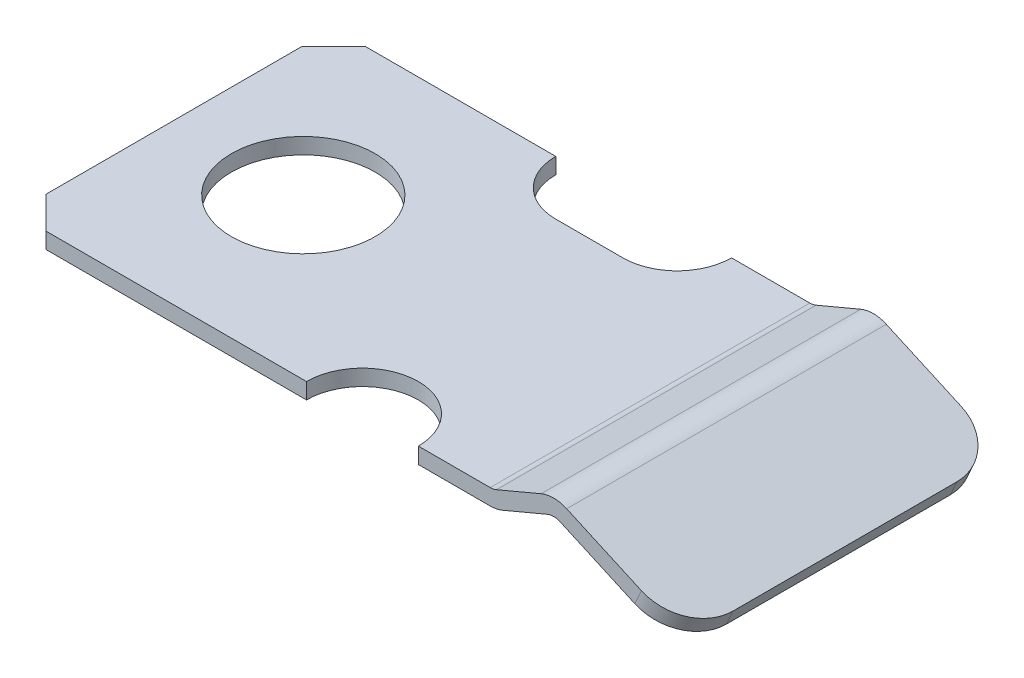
ISO-10303-21;
HEADER;
FILE_DESCRIPTION(('STEP AP214'),'2;1');
FILE_NAME('part.step','',(''),(''),'','','');
FILE_SCHEMA(('AUTOMOTIVE_DESIGN { 1 0 10303 214 1 1 1 1 }'));
ENDSEC;
DATA;
#1=APPLICATION_CONTEXT('core data for automotive mechanical design processes');
#2=APPLICATION_PROTOCOL_DEFINITION('international standard','automotive_design',2000,#1);
#3=PRODUCT_CONTEXT('',#1,'mechanical');
#4=PRODUCT('Part','Part','',(#3));
#5=PRODUCT_RELATED_PRODUCT_CATEGORY('part','',(#4));
#6=PRODUCT_DEFINITION_FORMATION('','',#4);
#7=PRODUCT_DEFINITION_CONTEXT('part definition',#1,'design');
#8=PRODUCT_DEFINITION('design','',#6,#7);
#9=PRODUCT_DEFINITION_SHAPE('','',#8);
#10=(LENGTH_UNIT() NAMED_UNIT(*) SI_UNIT(.MILLI.,.METRE.));
#11=(NAMED_UNIT(*) PLANE_ANGLE_UNIT() SI_UNIT($,.RADIAN.));
#12=(NAMED_UNIT(*) SI_UNIT($,.STERADIAN.) SOLID_ANGLE_UNIT());
#13=UNCERTAINTY_MEASURE_WITH_UNIT(LENGTH_MEASURE(1.E-05),#10,'distance_accuracy_value','');
#14=(GEOMETRIC_REPRESENTATION_CONTEXT(3) GLOBAL_UNCERTAINTY_ASSIGNED_CONTEXT((#13)) GLOBAL_UNIT_ASSIGNED_CONTEXT((#10,
#11,#12)) REPRESENTATION_CONTEXT('',''));
#15=CARTESIAN_POINT('',(0.,0.,0.));
#16=DIRECTION('',(0.,0.,1.));
#17=DIRECTION('',(1.,0.,0.));
#18=AXIS2_PLACEMENT_3D('',#15,#16,#17);
#19=CARTESIAN_POINT('',(14.8987900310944,1.,-5.));
#20=DIRECTION('',(0.,0.,1.));
#21=DIRECTION('',(1.,0.,0.));
#22=AXIS2_PLACEMENT_3D('',#19,#20,#21);
#23=PLANE('',#22);
#24=DIRECTION('',(-0.912195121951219,0.409756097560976,0.));
#25=VECTOR('',#24,1.);
#26=CARTESIAN_POINT('',(21.,-0.543902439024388,-5.));
#27=LINE('',#26,#25);
#28=CARTESIAN_POINT('',(19.6317073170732,0.0707317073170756,-5.));
#29=VERTEX_POINT('',#28);
#30=CARTESIAN_POINT('',(17.2924742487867,1.12151019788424,-5.));
#31=VERTEX_POINT('',#30);
#32=EDGE_CURVE('E321',#29,#31,#27,.T.);
#33=ORIENTED_EDGE('',*,*,#32,.F.);
#34=DIRECTION('',(0.409756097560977,0.912195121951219,0.));
#35=VECTOR('',#34,1.);
#36=CARTESIAN_POINT('',(19.1843898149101,-0.925082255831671,-5.));
#37=LINE('',#36,#35);
#38=CARTESIAN_POINT('',(19.4268292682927,-0.385365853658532,-5.));
#39=VERTEX_POINT('',#38);
#40=EDGE_CURVE('E54',#29,#39,#37,.F.);
#41=ORIENTED_EDGE('',*,*,#40,.T.);
#42=DIRECTION('',(0.912195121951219,-0.409756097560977,0.));
#43=VECTOR('',#42,1.);
#44=CARTESIAN_POINT('',(17.0875962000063,0.665412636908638,-5.));
#45=LINE('',#44,#43);
#46=CARTESIAN_POINT('',(17.0875962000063,0.665412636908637,-5.));
#47=VERTEX_POINT('',#46);
#48=EDGE_CURVE('E310',#47,#39,#45,.T.);
#49=ORIENTED_EDGE('',*,*,#48,.F.);
#50=CARTESIAN_POINT('',(16.8827181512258,0.209315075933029,-5.));
#51=DIRECTION('',(0.,0.,-1.));
#52=DIRECTION('',(-1.,0.,0.));
#53=AXIS2_PLACEMENT_3D('',#50,#51,#52);
#54=CIRCLE('',#53,0.5);
#55=CARTESIAN_POINT('',(16.688265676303,0.669954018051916,-5.));
#56=VERTEX_POINT('',#55);
#57=EDGE_CURVE('E328',#56,#47,#54,.T.);
#58=ORIENTED_EDGE('',*,*,#57,.F.);
#59=DIRECTION('',(0.921277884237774,0.388904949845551,0.));
#60=VECTOR('',#59,1.);
#61=CARTESIAN_POINT('',(15.2876949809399,0.0787221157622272,-5.));
#62=LINE('',#61,#60);
#63=CARTESIAN_POINT('',(15.2876949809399,0.0787221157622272,-5.));
#64=VERTEX_POINT('',#63);
#65=EDGE_CURVE('E352',#64,#56,#62,.T.);
#66=ORIENTED_EDGE('',*,*,#65,.F.);
#67=CARTESIAN_POINT('',(14.8987900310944,1.,-5.));
#68=DIRECTION('',(0.,0.,1.));
#69=DIRECTION('',(1.,0.,0.));
#70=AXIS2_PLACEMENT_3D('',#67,#68,#69);
#71=CIRCLE('',#70,1.);
#72=CARTESIAN_POINT('',(14.8987900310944,0.,-5.));
#73=VERTEX_POINT('',#72);
#74=EDGE_CURVE('E353',#73,#64,#71,.T.);
#75=ORIENTED_EDGE('',*,*,#74,.F.);
#76=DIRECTION('',(1.,0.,0.));
#77=VECTOR('',#76,1.);
#78=CARTESIAN_POINT('',(0.,0.,-5.));
#79=LINE('',#78,#77);
#80=CARTESIAN_POINT('',(12.45,0.,-5.));
#81=VERTEX_POINT('',#80);
#82=EDGE_CURVE('E201',#81,#73,#79,.T.);
#83=ORIENTED_EDGE('',*,*,#82,.F.);
#84=DIRECTION('',(0.,1.,0.));
#85=VECTOR('',#84,1.);
#86=CARTESIAN_POINT('',(12.45,-9.5,-5.));
#87=LINE('',#86,#85);
#88=CARTESIAN_POINT('',(12.45,0.5,-5.));
#89=VERTEX_POINT('',#88);
#90=EDGE_CURVE('E186',#81,#89,#87,.T.);
#91=ORIENTED_EDGE('',*,*,#90,.T.);
#92=DIRECTION('',(-1.,0.,0.));
#93=VECTOR('',#92,1.);
#94=CARTESIAN_POINT('',(0.,0.5,-5.));
#95=LINE('',#94,#93);
#96=CARTESIAN_POINT('',(14.8987900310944,0.499999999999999,-5.));
#97=VERTEX_POINT('',#96);
#98=EDGE_CURVE('E199',#97,#89,#95,.T.);
#99=ORIENTED_EDGE('',*,*,#98,.F.);
#100=CARTESIAN_POINT('',(14.8987900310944,1.,-5.));
#101=DIRECTION('',(0.,0.,-1.));
#102=DIRECTION('',(1.,0.,0.));
#103=AXIS2_PLACEMENT_3D('',#100,#101,#102);
#104=CIRCLE('',#103,0.500000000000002);
#105=CARTESIAN_POINT('',(15.0932425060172,0.539361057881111,-5.));
#106=VERTEX_POINT('',#105);
#107=EDGE_CURVE('E216',#106,#97,#104,.T.);
#108=ORIENTED_EDGE('',*,*,#107,.F.);
#109=DIRECTION('',(-0.921277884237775,-0.388904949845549,0.));
#110=VECTOR('',#109,1.);
#111=CARTESIAN_POINT('',(16.4938132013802,1.1305929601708,-5.));
#112=LINE('',#111,#110);
#113=CARTESIAN_POINT('',(16.4938132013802,1.1305929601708,-5.));
#114=VERTEX_POINT('',#113);
#115=EDGE_CURVE('E326',#114,#106,#112,.T.);
#116=ORIENTED_EDGE('',*,*,#115,.F.);
#117=CARTESIAN_POINT('',(16.8827181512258,0.209315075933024,-5.));
#118=DIRECTION('',(0.,0.,1.));
#119=DIRECTION('',(-1.,0.,0.));
#120=AXIS2_PLACEMENT_3D('',#117,#118,#119);
#121=CIRCLE('',#120,1.);
#122=EDGE_CURVE('E324',#31,#114,#121,.T.);
#123=ORIENTED_EDGE('',*,*,#122,.F.);
#124=EDGE_LOOP('',(#33,#41,#49,#58,#66,#75,#83,#91,#99,#108,#116,#123));
#125=FACE_BOUND('',#124,.T.);
#126=ADVANCED_FACE('F31',(#125),#23,.F.);
#127=CARTESIAN_POINT('',(14.8987900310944,1.,5.));
#128=DIRECTION('',(0.,0.,1.));
#129=DIRECTION('',(1.,0.,0.));
#130=AXIS2_PLACEMENT_3D('',#127,#128,#129);
#131=PLANE('',#130);
#132=DIRECTION('',(0.912195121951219,-0.409756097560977,0.));
#133=VECTOR('',#132,1.);
#134=CARTESIAN_POINT('',(17.0875962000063,0.665412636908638,5.));
#135=LINE('',#134,#133);
#136=CARTESIAN_POINT('',(17.0875962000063,0.665412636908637,5.));
#137=VERTEX_POINT('',#136);
#138=CARTESIAN_POINT('',(19.4268292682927,-0.385365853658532,5.));
#139=VERTEX_POINT('',#138);
#140=EDGE_CURVE('E226',#137,#139,#135,.T.);
#141=ORIENTED_EDGE('',*,*,#140,.T.);
#142=DIRECTION('',(0.409756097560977,0.912195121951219,0.));
#143=VECTOR('',#142,1.);
#144=CARTESIAN_POINT('',(19.6317073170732,0.0707317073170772,5.));
#145=LINE('',#144,#143);
#146=CARTESIAN_POINT('',(19.6317073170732,0.0707317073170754,5.));
#147=VERTEX_POINT('',#146);
#148=EDGE_CURVE('E11',#139,#147,#145,.T.);
#149=ORIENTED_EDGE('',*,*,#148,.T.);
#150=DIRECTION('',(-0.912195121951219,0.409756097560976,0.));
#151=VECTOR('',#150,1.);
#152=CARTESIAN_POINT('',(21.,-0.543902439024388,5.));
#153=LINE('',#152,#151);
#154=CARTESIAN_POINT('',(17.2924742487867,1.12151019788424,5.));
#155=VERTEX_POINT('',#154);
#156=EDGE_CURVE('E228',#147,#155,#153,.T.);
#157=ORIENTED_EDGE('',*,*,#156,.T.);
#158=CARTESIAN_POINT('',(16.8827181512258,0.209315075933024,5.));
#159=DIRECTION('',(0.,0.,1.));
#160=DIRECTION('',(-1.,0.,0.));
#161=AXIS2_PLACEMENT_3D('',#158,#159,#160);
#162=CIRCLE('',#161,1.);
#163=CARTESIAN_POINT('',(16.4938132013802,1.1305929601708,5.));
#164=VERTEX_POINT('',#163);
#165=EDGE_CURVE('E230',#155,#164,#162,.T.);
#166=ORIENTED_EDGE('',*,*,#165,.T.);
#167=DIRECTION('',(-0.921277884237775,-0.388904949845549,0.));
#168=VECTOR('',#167,1.);
#169=CARTESIAN_POINT('',(16.4938132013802,1.1305929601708,5.));
#170=LINE('',#169,#168);
#171=CARTESIAN_POINT('',(15.0932425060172,0.539361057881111,5.));
#172=VERTEX_POINT('',#171);
#173=EDGE_CURVE('E232',#164,#172,#170,.T.);
#174=ORIENTED_EDGE('',*,*,#173,.T.);
#175=CARTESIAN_POINT('',(14.8987900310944,1.,5.));
#176=DIRECTION('',(0.,0.,-1.));
#177=DIRECTION('',(1.,0.,0.));
#178=AXIS2_PLACEMENT_3D('',#175,#176,#177);
#179=CIRCLE('',#178,0.500000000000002);
#180=CARTESIAN_POINT('',(14.8987900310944,0.499999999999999,5.));
#181=VERTEX_POINT('',#180);
#182=EDGE_CURVE('E234',#172,#181,#179,.T.);
#183=ORIENTED_EDGE('',*,*,#182,.T.);
#184=DIRECTION('',(-1.,0.,0.));
#185=VECTOR('',#184,1.);
#186=CARTESIAN_POINT('',(0.,0.5,5.));
#187=LINE('',#186,#185);
#188=CARTESIAN_POINT('',(12.65,0.5,5.));
#189=VERTEX_POINT('',#188);
#190=EDGE_CURVE('E237',#181,#189,#187,.T.);
#191=ORIENTED_EDGE('',*,*,#190,.T.);
#192=DIRECTION('',(0.,1.,0.));
#193=VECTOR('',#192,1.);
#194=CARTESIAN_POINT('',(12.65,-9.5,5.));
#195=LINE('',#194,#193);
#196=CARTESIAN_POINT('',(12.65,0.,5.));
#197=VERTEX_POINT('',#196);
#198=EDGE_CURVE('E277',#197,#189,#195,.T.);
#199=ORIENTED_EDGE('',*,*,#198,.F.);
#200=DIRECTION('',(1.,0.,0.));
#201=VECTOR('',#200,1.);
#202=CARTESIAN_POINT('',(0.,0.,5.));
#203=LINE('',#202,#201);
#204=CARTESIAN_POINT('',(14.8987900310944,0.,5.));
#205=VERTEX_POINT('',#204);
#206=EDGE_CURVE('E211',#197,#205,#203,.T.);
#207=ORIENTED_EDGE('',*,*,#206,.T.);
#208=CARTESIAN_POINT('',(14.8987900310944,1.,5.));
#209=DIRECTION('',(0.,0.,1.));
#210=DIRECTION('',(1.,0.,0.));
#211=AXIS2_PLACEMENT_3D('',#208,#209,#210);
#212=CIRCLE('',#211,1.);
#213=CARTESIAN_POINT('',(15.2876949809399,0.0787221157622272,5.));
#214=VERTEX_POINT('',#213);
#215=EDGE_CURVE('E220',#205,#214,#212,.T.);
#216=ORIENTED_EDGE('',*,*,#215,.T.);
#217=DIRECTION('',(0.921277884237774,0.388904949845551,0.));
#218=VECTOR('',#217,1.);
#219=CARTESIAN_POINT('',(15.2876949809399,0.0787221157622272,5.));
#220=LINE('',#219,#218);
#221=CARTESIAN_POINT('',(16.688265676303,0.669954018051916,5.));
#222=VERTEX_POINT('',#221);
#223=EDGE_CURVE('E222',#214,#222,#220,.T.);
#224=ORIENTED_EDGE('',*,*,#223,.T.);
#225=CARTESIAN_POINT('',(16.8827181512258,0.209315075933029,5.));
#226=DIRECTION('',(0.,0.,-1.));
#227=DIRECTION('',(-1.,0.,0.));
#228=AXIS2_PLACEMENT_3D('',#225,#226,#227);
#229=CIRCLE('',#228,0.5);
#230=EDGE_CURVE('E224',#222,#137,#229,.T.);
#231=ORIENTED_EDGE('',*,*,#230,.T.);
#232=EDGE_LOOP('',(#141,#149,#157,#166,#174,#183,#191,#199,#207,#216,#224,#231));
#233=FACE_BOUND('',#232,.T.);
#234=ADVANCED_FACE('F340',(#233),#131,.T.);
#235=CARTESIAN_POINT('',(0.,0.,5.));
#236=DIRECTION('',(1.,0.,0.));
#237=DIRECTION('',(0.,0.,-1.));
#238=AXIS2_PLACEMENT_3D('',#235,#236,#237);
#239=PLANE('',#238);
#240=DIRECTION('',(0.,0.,-1.));
#241=VECTOR('',#240,1.);
#242=CARTESIAN_POINT('',(0.,0.5,5.));
#243=LINE('',#242,#241);
#244=CARTESIAN_POINT('',(0.,0.5,4.));
#245=VERTEX_POINT('',#244);
#246=CARTESIAN_POINT('',(0.,0.5,-4.));
#247=VERTEX_POINT('',#246);
#248=EDGE_CURVE('E240',#245,#247,#243,.T.);
#249=ORIENTED_EDGE('',*,*,#248,.T.);
#250=DIRECTION('',(0.,-1.,0.));
#251=VECTOR('',#250,1.);
#252=CARTESIAN_POINT('',(0.,0.,-4.));
#253=LINE('',#252,#251);
#254=CARTESIAN_POINT('',(0.,0.,-4.));
#255=VERTEX_POINT('',#254);
#256=EDGE_CURVE('E282',#247,#255,#253,.T.);
#257=ORIENTED_EDGE('',*,*,#256,.T.);
#258=DIRECTION('',(0.,0.,-1.));
#259=VECTOR('',#258,1.);
#260=CARTESIAN_POINT('',(0.,0.,5.));
#261=LINE('',#260,#259);
#262=CARTESIAN_POINT('',(0.,0.,4.));
#263=VERTEX_POINT('',#262);
#264=EDGE_CURVE('E271',#263,#255,#261,.T.);
#265=ORIENTED_EDGE('',*,*,#264,.F.);
#266=DIRECTION('',(0.,1.,0.));
#267=VECTOR('',#266,1.);
#268=CARTESIAN_POINT('',(0.,0.5,4.));
#269=LINE('',#268,#267);
#270=EDGE_CURVE('E202',#263,#245,#269,.T.);
#271=ORIENTED_EDGE('',*,*,#270,.T.);
#272=EDGE_LOOP('',(#249,#257,#265,#271));
#273=FACE_BOUND('',#272,.T.);
#274=ADVANCED_FACE('F405',(#273),#239,.F.);
#275=CARTESIAN_POINT('',(0.,0.,5.));
#276=DIRECTION('',(0.,1.,0.));
#277=DIRECTION('',(0.,0.,1.));
#278=AXIS2_PLACEMENT_3D('',#275,#276,#277);
#279=PLANE('',#278);
#280=CARTESIAN_POINT('',(4.05,0.,0.));
#281=DIRECTION('',(0.,1.,0.));
#282=DIRECTION('',(0.,0.,1.));
#283=AXIS2_PLACEMENT_3D('',#280,#281,#282);
#284=CIRCLE('',#283,2.25);
#285=CARTESIAN_POINT('',(4.05,0.,2.25));
#286=VERTEX_POINT('',#285);
#287=EDGE_CURVE('E359',#286,#286,#284,.T.);
#288=ORIENTED_EDGE('',*,*,#287,.T.);
#289=EDGE_LOOP('',(#288));
#290=FACE_BOUND('',#289,.T.);
#291=ORIENTED_EDGE('',*,*,#264,.T.);
#292=DIRECTION('',(-0.707106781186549,0.,0.707106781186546));
#293=VECTOR('',#292,1.);
#294=CARTESIAN_POINT('',(0.,0.,-4.));
#295=LINE('',#294,#293);
#296=CARTESIAN_POINT('',(1.,0.,-5.));
#297=VERTEX_POINT('',#296);
#298=EDGE_CURVE('E287',#255,#297,#295,.F.);
#299=ORIENTED_EDGE('',*,*,#298,.T.);
#300=CARTESIAN_POINT('',(6.95,0.,-5.));
#301=VERTEX_POINT('',#300);
#302=EDGE_CURVE('E357',#297,#301,#79,.T.);
#303=ORIENTED_EDGE('',*,*,#302,.T.);
#304=CARTESIAN_POINT('',(8.65,0.,-5.));
#305=DIRECTION('',(0.,1.,0.));
#306=DIRECTION('',(0.,0.,1.));
#307=AXIS2_PLACEMENT_3D('',#304,#305,#306);
#308=CIRCLE('',#307,1.7);
#309=CARTESIAN_POINT('',(8.65,0.,-3.3));
#310=VERTEX_POINT('',#309);
#311=EDGE_CURVE('E375',#301,#310,#308,.T.);
#312=ORIENTED_EDGE('',*,*,#311,.T.);
#313=DIRECTION('',(1.,0.,0.));
#314=VECTOR('',#313,1.);
#315=CARTESIAN_POINT('',(0.,0.,-3.3));
#316=LINE('',#315,#314);
#317=CARTESIAN_POINT('',(10.75,0.,-3.3));
#318=VERTEX_POINT('',#317);
#319=EDGE_CURVE('E370',#310,#318,#316,.T.);
#320=ORIENTED_EDGE('',*,*,#319,.T.);
#321=CARTESIAN_POINT('',(10.75,0.,-5.));
#322=DIRECTION('',(0.,1.,0.));
#323=DIRECTION('',(0.,0.,1.));
#324=AXIS2_PLACEMENT_3D('',#321,#322,#323);
#325=CIRCLE('',#324,1.7);
#326=EDGE_CURVE('E373',#318,#81,#325,.T.);
#327=ORIENTED_EDGE('',*,*,#326,.T.);
#328=ORIENTED_EDGE('',*,*,#82,.T.);
#329=DIRECTION('',(0.,0.,-1.));
#330=VECTOR('',#329,1.);
#331=CARTESIAN_POINT('',(14.8987900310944,0.,5.));
#332=LINE('',#331,#330);
#333=EDGE_CURVE('E268',#205,#73,#332,.T.);
#334=ORIENTED_EDGE('',*,*,#333,.F.);
#335=ORIENTED_EDGE('',*,*,#206,.F.);
#336=CARTESIAN_POINT('',(10.9,0.,5.));
#337=DIRECTION('',(0.,1.,0.));
#338=DIRECTION('',(0.,0.,1.));
#339=AXIS2_PLACEMENT_3D('',#336,#337,#338);
#340=CIRCLE('',#339,1.75);
#341=CARTESIAN_POINT('',(9.15,0.,5.));
#342=VERTEX_POINT('',#341);
#343=EDGE_CURVE('E365',#197,#342,#340,.T.);
#344=ORIENTED_EDGE('',*,*,#343,.T.);
#345=CARTESIAN_POINT('',(1.,0.,5.));
#346=VERTEX_POINT('',#345);
#347=EDGE_CURVE('E214',#346,#342,#203,.T.);
#348=ORIENTED_EDGE('',*,*,#347,.F.);
#349=DIRECTION('',(-0.707106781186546,0.,-0.707106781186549));
#350=VECTOR('',#349,1.);
#351=CARTESIAN_POINT('',(1.,0.,5.));
#352=LINE('',#351,#350);
#353=EDGE_CURVE('E285',#346,#263,#352,.T.);
#354=ORIENTED_EDGE('',*,*,#353,.T.);
#355=EDGE_LOOP('',(#291,#299,#303,#312,#320,#327,#328,#334,#335,#344,#348,#354));
#356=FACE_BOUND('',#355,.T.);
#357=ADVANCED_FACE('F393',(#290,#356),#279,.F.);
#358=CARTESIAN_POINT('',(14.8987900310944,1.,5.));
#359=DIRECTION('',(0.,0.,-1.));
#360=DIRECTION('',(-1.,0.,0.));
#361=AXIS2_PLACEMENT_3D('',#358,#359,#360);
#362=CYLINDRICAL_SURFACE('',#361,1.);
#363=ORIENTED_EDGE('',*,*,#74,.T.);
#364=DIRECTION('',(0.,0.,-1.));
#365=VECTOR('',#364,1.);
#366=CARTESIAN_POINT('',(15.2876949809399,0.0787221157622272,5.));
#367=LINE('',#366,#365);
#368=EDGE_CURVE('E265',#214,#64,#367,.T.);
#369=ORIENTED_EDGE('',*,*,#368,.F.);
#370=ORIENTED_EDGE('',*,*,#215,.F.);
#371=ORIENTED_EDGE('',*,*,#333,.T.);
#372=EDGE_LOOP('',(#363,#369,#370,#371));
#373=FACE_BOUND('',#372,.T.);
#374=ADVANCED_FACE('F425',(#373),#362,.T.);
#375=CARTESIAN_POINT('',(15.2876949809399,0.0787221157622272,5.));
#376=DIRECTION('',(-0.388904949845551,0.921277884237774,0.));
#377=DIRECTION('',(-0.921277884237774,-0.388904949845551,0.));
#378=AXIS2_PLACEMENT_3D('',#375,#376,#377);
#379=PLANE('',#378);
#380=ORIENTED_EDGE('',*,*,#65,.T.);
#381=DIRECTION('',(0.,0.,-1.));
#382=VECTOR('',#381,1.);
#383=CARTESIAN_POINT('',(16.688265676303,0.669954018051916,5.));
#384=LINE('',#383,#382);
#385=EDGE_CURVE('E262',#222,#56,#384,.T.);
#386=ORIENTED_EDGE('',*,*,#385,.F.);
#387=ORIENTED_EDGE('',*,*,#223,.F.);
#388=ORIENTED_EDGE('',*,*,#368,.T.);
#389=EDGE_LOOP('',(#380,#386,#387,#388));
#390=FACE_BOUND('',#389,.T.);
#391=ADVANCED_FACE('F429',(#390),#379,.F.);
#392=CARTESIAN_POINT('',(16.8827181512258,0.209315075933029,5.));
#393=DIRECTION('',(0.,0.,-1.));
#394=DIRECTION('',(-1.,0.,0.));
#395=AXIS2_PLACEMENT_3D('',#392,#393,#394);
#396=CYLINDRICAL_SURFACE('',#395,0.5);
#397=ORIENTED_EDGE('',*,*,#57,.T.);
#398=DIRECTION('',(0.,0.,-1.));
#399=VECTOR('',#398,1.);
#400=CARTESIAN_POINT('',(17.0875962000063,0.665412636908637,5.));
#401=LINE('',#400,#399);
#402=EDGE_CURVE('E259',#137,#47,#401,.T.);
#403=ORIENTED_EDGE('',*,*,#402,.F.);
#404=ORIENTED_EDGE('',*,*,#230,.F.);
#405=ORIENTED_EDGE('',*,*,#385,.T.);
#406=EDGE_LOOP('',(#397,#403,#404,#405));
#407=FACE_BOUND('',#406,.T.);
#408=ADVANCED_FACE('F430',(#407),#396,.F.);
#409=CARTESIAN_POINT('',(17.0875962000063,0.665412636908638,5.));
#410=DIRECTION('',(0.409756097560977,0.912195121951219,0.));
#411=DIRECTION('',(-0.912195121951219,0.409756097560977,0.));
#412=AXIS2_PLACEMENT_3D('',#409,#410,#411);
#413=PLANE('',#412);
#414=ORIENTED_EDGE('',*,*,#48,.T.);
#415=CARTESIAN_POINT('',(19.4268292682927,-0.385365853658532,-3.5));
#416=DIRECTION('',(0.409756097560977,0.912195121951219,0.));
#417=DIRECTION('',(-0.912195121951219,0.409756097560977,0.));
#418=AXIS2_PLACEMENT_3D('',#415,#416,#417);
#419=CIRCLE('',#418,1.5);
#420=CARTESIAN_POINT('',(20.7951219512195,-0.999999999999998,-3.5));
#421=VERTEX_POINT('',#420);
#422=EDGE_CURVE('E39',#39,#421,#419,.F.);
#423=ORIENTED_EDGE('',*,*,#422,.T.);
#424=DIRECTION('',(0.,0.,-1.));
#425=VECTOR('',#424,1.);
#426=CARTESIAN_POINT('',(20.7951219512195,-0.999999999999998,5.));
#427=LINE('',#426,#425);
#428=CARTESIAN_POINT('',(20.7951219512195,-0.999999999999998,3.5));
#429=VERTEX_POINT('',#428);
#430=EDGE_CURVE('E256',#429,#421,#427,.T.);
#431=ORIENTED_EDGE('',*,*,#430,.F.);
#432=CARTESIAN_POINT('',(19.4268292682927,-0.385365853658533,3.5));
#433=DIRECTION('',(0.409756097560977,0.912195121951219,0.));
#434=DIRECTION('',(-0.912195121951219,0.409756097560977,0.));
#435=AXIS2_PLACEMENT_3D('',#432,#433,#434);
#436=CIRCLE('',#435,1.5);
#437=EDGE_CURVE('E46',#429,#139,#436,.F.);
#438=ORIENTED_EDGE('',*,*,#437,.T.);
#439=ORIENTED_EDGE('',*,*,#140,.F.);
#440=ORIENTED_EDGE('',*,*,#402,.T.);
#441=EDGE_LOOP('',(#414,#423,#431,#438,#439,#440));
#442=FACE_BOUND('',#441,.T.);
#443=ADVANCED_FACE('F309',(#442),#413,.F.);
#444=CARTESIAN_POINT('',(20.7951219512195,-0.999999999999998,5.));
#445=DIRECTION('',(-0.912195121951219,0.409756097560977,0.));
#446=DIRECTION('',(-0.409756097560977,-0.912195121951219,0.));
#447=AXIS2_PLACEMENT_3D('',#444,#445,#446);
#448=PLANE('',#447);
#449=ORIENTED_EDGE('',*,*,#430,.T.);
#450=DIRECTION('',(0.409756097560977,0.912195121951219,0.));
#451=VECTOR('',#450,1.);
#452=CARTESIAN_POINT('',(20.7951219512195,-0.999999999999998,-3.5));
#453=LINE('',#452,#451);
#454=CARTESIAN_POINT('',(21.,-0.543902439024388,-3.5));
#455=VERTEX_POINT('',#454);
#456=EDGE_CURVE('E300',#421,#455,#453,.T.);
#457=ORIENTED_EDGE('',*,*,#456,.T.);
#458=DIRECTION('',(0.,0.,-1.));
#459=VECTOR('',#458,1.);
#460=CARTESIAN_POINT('',(21.,-0.543902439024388,5.));
#461=LINE('',#460,#459);
#462=CARTESIAN_POINT('',(21.,-0.543902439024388,3.5));
#463=VERTEX_POINT('',#462);
#464=EDGE_CURVE('E253',#463,#455,#461,.T.);
#465=ORIENTED_EDGE('',*,*,#464,.F.);
#466=DIRECTION('',(0.409756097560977,0.912195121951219,0.));
#467=VECTOR('',#466,1.);
#468=CARTESIAN_POINT('',(20.7951219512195,-0.999999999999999,3.5));
#469=LINE('',#468,#467);
#470=EDGE_CURVE('E298',#463,#429,#469,.F.);
#471=ORIENTED_EDGE('',*,*,#470,.T.);
#472=EDGE_LOOP('',(#449,#457,#465,#471));
#473=FACE_BOUND('',#472,.T.);
#474=ADVANCED_FACE('F314',(#473),#448,.F.);
#475=CARTESIAN_POINT('',(21.,-0.543902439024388,5.));
#476=DIRECTION('',(-0.409756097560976,-0.912195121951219,0.));
#477=DIRECTION('',(0.91219512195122,-0.409756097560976,0.));
#478=AXIS2_PLACEMENT_3D('',#475,#476,#477);
#479=PLANE('',#478);
#480=ORIENTED_EDGE('',*,*,#464,.T.);
#481=CARTESIAN_POINT('',(19.6317073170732,0.0707317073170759,-3.5));
#482=DIRECTION('',(-0.409756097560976,-0.912195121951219,0.));
#483=DIRECTION('',(0.91219512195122,-0.409756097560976,0.));
#484=AXIS2_PLACEMENT_3D('',#481,#482,#483);
#485=CIRCLE('',#484,1.5);
#486=EDGE_CURVE('E305',#455,#29,#485,.F.);
#487=ORIENTED_EDGE('',*,*,#486,.T.);
#488=ORIENTED_EDGE('',*,*,#32,.T.);
#489=DIRECTION('',(0.,0.,-1.));
#490=VECTOR('',#489,1.);
#491=CARTESIAN_POINT('',(17.2924742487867,1.12151019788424,5.));
#492=LINE('',#491,#490);
#493=EDGE_CURVE('E250',#155,#31,#492,.T.);
#494=ORIENTED_EDGE('',*,*,#493,.F.);
#495=ORIENTED_EDGE('',*,*,#156,.F.);
#496=CARTESIAN_POINT('',(19.6317073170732,0.0707317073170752,3.5));
#497=DIRECTION('',(-0.409756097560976,-0.912195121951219,0.));
#498=DIRECTION('',(0.91219512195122,-0.409756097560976,0.));
#499=AXIS2_PLACEMENT_3D('',#496,#497,#498);
#500=CIRCLE('',#499,1.5);
#501=EDGE_CURVE('E303',#147,#463,#500,.F.);
#502=ORIENTED_EDGE('',*,*,#501,.T.);
#503=EDGE_LOOP('',(#480,#487,#488,#494,#495,#502));
#504=FACE_BOUND('',#503,.T.);
#505=ADVANCED_FACE('F319',(#504),#479,.F.);
#506=CARTESIAN_POINT('',(16.8827181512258,0.209315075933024,5.));
#507=DIRECTION('',(0.,0.,-1.));
#508=DIRECTION('',(-1.,0.,0.));
#509=AXIS2_PLACEMENT_3D('',#506,#507,#508);
#510=CYLINDRICAL_SURFACE('',#509,1.);
#511=ORIENTED_EDGE('',*,*,#122,.T.);
#512=DIRECTION('',(0.,0.,-1.));
#513=VECTOR('',#512,1.);
#514=CARTESIAN_POINT('',(16.4938132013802,1.1305929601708,5.));
#515=LINE('',#514,#513);
#516=EDGE_CURVE('E247',#164,#114,#515,.T.);
#517=ORIENTED_EDGE('',*,*,#516,.F.);
#518=ORIENTED_EDGE('',*,*,#165,.F.);
#519=ORIENTED_EDGE('',*,*,#493,.T.);
#520=EDGE_LOOP('',(#511,#517,#518,#519));
#521=FACE_BOUND('',#520,.T.);
#522=ADVANCED_FACE('F344',(#521),#510,.T.);
#523=CARTESIAN_POINT('',(16.4938132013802,1.1305929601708,5.));
#524=DIRECTION('',(0.388904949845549,-0.921277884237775,0.));
#525=DIRECTION('',(0.921277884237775,0.388904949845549,0.));
#526=AXIS2_PLACEMENT_3D('',#523,#524,#525);
#527=PLANE('',#526);
#528=ORIENTED_EDGE('',*,*,#115,.T.);
#529=DIRECTION('',(0.,0.,-1.));
#530=VECTOR('',#529,1.);
#531=CARTESIAN_POINT('',(15.0932425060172,0.539361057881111,5.));
#532=LINE('',#531,#530);
#533=EDGE_CURVE('E244',#172,#106,#532,.T.);
#534=ORIENTED_EDGE('',*,*,#533,.F.);
#535=ORIENTED_EDGE('',*,*,#173,.F.);
#536=ORIENTED_EDGE('',*,*,#516,.T.);
#537=EDGE_LOOP('',(#528,#534,#535,#536));
#538=FACE_BOUND('',#537,.T.);
#539=ADVANCED_FACE('F337',(#538),#527,.F.);
#540=CARTESIAN_POINT('',(14.8987900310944,1.,5.));
#541=DIRECTION('',(0.,0.,-1.));
#542=DIRECTION('',(-1.,0.,0.));
#543=AXIS2_PLACEMENT_3D('',#540,#541,#542);
#544=CYLINDRICAL_SURFACE('',#543,0.500000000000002);
#545=ORIENTED_EDGE('',*,*,#107,.T.);
#546=DIRECTION('',(0.,0.,-1.));
#547=VECTOR('',#546,1.);
#548=CARTESIAN_POINT('',(14.8987900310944,0.499999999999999,5.));
#549=LINE('',#548,#547);
#550=EDGE_CURVE('E210',#181,#97,#549,.T.);
#551=ORIENTED_EDGE('',*,*,#550,.F.);
#552=ORIENTED_EDGE('',*,*,#182,.F.);
#553=ORIENTED_EDGE('',*,*,#533,.T.);
#554=EDGE_LOOP('',(#545,#551,#552,#553));
#555=FACE_BOUND('',#554,.T.);
#556=ADVANCED_FACE('F334',(#555),#544,.F.);
#557=CARTESIAN_POINT('',(0.,0.5,5.));
#558=DIRECTION('',(0.,-1.,0.));
#559=DIRECTION('',(1.,0.,0.));
#560=AXIS2_PLACEMENT_3D('',#557,#558,#559);
#561=PLANE('',#560);
#562=CARTESIAN_POINT('',(4.05,0.5,0.));
#563=DIRECTION('',(0.,1.,0.));
#564=DIRECTION('',(-1.,0.,0.));
#565=AXIS2_PLACEMENT_3D('',#562,#563,#564);
#566=CIRCLE('',#565,2.25);
#567=CARTESIAN_POINT('',(1.8,0.5,0.));
#568=VERTEX_POINT('',#567);
#569=EDGE_CURVE('E362',#568,#568,#566,.T.);
#570=ORIENTED_EDGE('',*,*,#569,.F.);
#571=EDGE_LOOP('',(#570));
#572=FACE_BOUND('',#571,.T.);
#573=CARTESIAN_POINT('',(6.95,0.5,-5.));
#574=VERTEX_POINT('',#573);
#575=CARTESIAN_POINT('',(1.,0.5,-5.));
#576=VERTEX_POINT('',#575);
#577=EDGE_CURVE('E212',#574,#576,#95,.T.);
#578=ORIENTED_EDGE('',*,*,#577,.T.);
#579=DIRECTION('',(0.707106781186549,0.,-0.707106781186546));
#580=VECTOR('',#579,1.);
#581=CARTESIAN_POINT('',(0.,0.5,-4.));
#582=LINE('',#581,#580);
#583=EDGE_CURVE('E293',#576,#247,#582,.F.);
#584=ORIENTED_EDGE('',*,*,#583,.T.);
#585=ORIENTED_EDGE('',*,*,#248,.F.);
#586=DIRECTION('',(0.707106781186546,0.,0.707106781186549));
#587=VECTOR('',#586,1.);
#588=CARTESIAN_POINT('',(1.,0.5,5.));
#589=LINE('',#588,#587);
#590=CARTESIAN_POINT('',(1.,0.5,5.));
#591=VERTEX_POINT('',#590);
#592=EDGE_CURVE('E291',#245,#591,#589,.T.);
#593=ORIENTED_EDGE('',*,*,#592,.T.);
#594=CARTESIAN_POINT('',(9.15,0.5,5.));
#595=VERTEX_POINT('',#594);
#596=EDGE_CURVE('E236',#595,#591,#187,.T.);
#597=ORIENTED_EDGE('',*,*,#596,.F.);
#598=CARTESIAN_POINT('',(10.9,0.5,5.));
#599=DIRECTION('',(0.,1.,0.));
#600=DIRECTION('',(-1.,0.,0.));
#601=AXIS2_PLACEMENT_3D('',#598,#599,#600);
#602=CIRCLE('',#601,1.75);
#603=EDGE_CURVE('E368',#189,#595,#602,.T.);
#604=ORIENTED_EDGE('',*,*,#603,.F.);
#605=ORIENTED_EDGE('',*,*,#190,.F.);
#606=ORIENTED_EDGE('',*,*,#550,.T.);
#607=ORIENTED_EDGE('',*,*,#98,.T.);
#608=CARTESIAN_POINT('',(10.75,0.5,-5.));
#609=DIRECTION('',(0.,1.,0.));
#610=DIRECTION('',(-1.,0.,0.));
#611=AXIS2_PLACEMENT_3D('',#608,#609,#610);
#612=CIRCLE('',#611,1.7);
#613=CARTESIAN_POINT('',(10.75,0.5,-3.3));
#614=VERTEX_POINT('',#613);
#615=EDGE_CURVE('E183',#614,#89,#612,.T.);
#616=ORIENTED_EDGE('',*,*,#615,.F.);
#617=DIRECTION('',(1.,0.,0.));
#618=VECTOR('',#617,1.);
#619=CARTESIAN_POINT('',(10.75,0.5,-3.3));
#620=LINE('',#619,#618);
#621=CARTESIAN_POINT('',(8.65,0.5,-3.3));
#622=VERTEX_POINT('',#621);
#623=EDGE_CURVE('E380',#622,#614,#620,.T.);
#624=ORIENTED_EDGE('',*,*,#623,.F.);
#625=CARTESIAN_POINT('',(8.65,0.5,-5.));
#626=DIRECTION('',(0.,1.,0.));
#627=DIRECTION('',(-1.,0.,0.));
#628=AXIS2_PLACEMENT_3D('',#625,#626,#627);
#629=CIRCLE('',#628,1.7);
#630=EDGE_CURVE('E194',#574,#622,#629,.T.);
#631=ORIENTED_EDGE('',*,*,#630,.F.);
#632=EDGE_LOOP('',(#578,#584,#585,#593,#597,#604,#605,#606,#607,#616,#624,#631));
#633=FACE_BOUND('',#632,.T.);
#634=ADVANCED_FACE('F207',(#572,#633),#561,.F.);
#635=ORIENTED_EDGE('',*,*,#596,.T.);
#636=DIRECTION('',(0.,-1.,0.));
#637=VECTOR('',#636,1.);
#638=CARTESIAN_POINT('',(1.,0.,5.));
#639=LINE('',#638,#637);
#640=EDGE_CURVE('E295',#591,#346,#639,.T.);
#641=ORIENTED_EDGE('',*,*,#640,.T.);
#642=ORIENTED_EDGE('',*,*,#347,.T.);
#643=DIRECTION('',(0.,1.,0.));
#644=VECTOR('',#643,1.);
#645=CARTESIAN_POINT('',(9.15,-9.5,5.));
#646=LINE('',#645,#644);
#647=EDGE_CURVE('E274',#595,#342,#646,.F.);
#648=ORIENTED_EDGE('',*,*,#647,.F.);
#649=EDGE_LOOP('',(#635,#641,#642,#648));
#650=FACE_BOUND('',#649,.T.);
#651=ADVANCED_FACE('F414',(#650),#131,.T.);
#652=ORIENTED_EDGE('',*,*,#302,.F.);
#653=DIRECTION('',(0.,1.,0.));
#654=VECTOR('',#653,1.);
#655=CARTESIAN_POINT('',(1.,1.,-5.));
#656=LINE('',#655,#654);
#657=EDGE_CURVE('E289',#297,#576,#656,.T.);
#658=ORIENTED_EDGE('',*,*,#657,.T.);
#659=ORIENTED_EDGE('',*,*,#577,.F.);
#660=DIRECTION('',(0.,1.,0.));
#661=VECTOR('',#660,1.);
#662=CARTESIAN_POINT('',(6.95,-9.5,-5.));
#663=LINE('',#662,#661);
#664=EDGE_CURVE('E203',#574,#301,#663,.F.);
#665=ORIENTED_EDGE('',*,*,#664,.T.);
#666=EDGE_LOOP('',(#652,#658,#659,#665));
#667=FACE_BOUND('',#666,.T.);
#668=ADVANCED_FACE('F396',(#667),#23,.F.);
#669=CARTESIAN_POINT('',(4.05,-9.5,0.));
#670=DIRECTION('',(0.,1.,0.));
#671=DIRECTION('',(-1.,0.,0.));
#672=AXIS2_PLACEMENT_3D('',#669,#670,#671);
#673=CYLINDRICAL_SURFACE('',#672,2.25);
#674=ORIENTED_EDGE('',*,*,#569,.T.);
#675=EDGE_LOOP('',(#674));
#676=FACE_BOUND('',#675,.T.);
#677=ORIENTED_EDGE('',*,*,#287,.F.);
#678=EDGE_LOOP('',(#677));
#679=FACE_BOUND('',#678,.T.);
#680=ADVANCED_FACE('F447',(#676,#679),#673,.F.);
#681=CARTESIAN_POINT('',(10.9,-9.5,5.));
#682=DIRECTION('',(0.,1.,0.));
#683=DIRECTION('',(-1.,0.,0.));
#684=AXIS2_PLACEMENT_3D('',#681,#682,#683);
#685=CYLINDRICAL_SURFACE('',#684,1.75);
#686=ORIENTED_EDGE('',*,*,#198,.T.);
#687=ORIENTED_EDGE('',*,*,#603,.T.);
#688=ORIENTED_EDGE('',*,*,#647,.T.);
#689=ORIENTED_EDGE('',*,*,#343,.F.);
#690=EDGE_LOOP('',(#686,#687,#688,#689));
#691=FACE_BOUND('',#690,.T.);
#692=ADVANCED_FACE('F452',(#691),#685,.F.);
#693=CARTESIAN_POINT('',(10.75,-9.5,-3.3));
#694=DIRECTION('',(0.,0.,1.));
#695=DIRECTION('',(1.,0.,0.));
#696=AXIS2_PLACEMENT_3D('',#693,#694,#695);
#697=PLANE('',#696);
#698=DIRECTION('',(0.,1.,0.));
#699=VECTOR('',#698,1.);
#700=CARTESIAN_POINT('',(8.65,-9.5,-3.3));
#701=LINE('',#700,#699);
#702=EDGE_CURVE('E378',#310,#622,#701,.T.);
#703=ORIENTED_EDGE('',*,*,#702,.T.);
#704=ORIENTED_EDGE('',*,*,#623,.T.);
#705=DIRECTION('',(0.,1.,0.));
#706=VECTOR('',#705,1.);
#707=CARTESIAN_POINT('',(10.75,-9.5,-3.3));
#708=LINE('',#707,#706);
#709=EDGE_CURVE('E189',#318,#614,#708,.T.);
#710=ORIENTED_EDGE('',*,*,#709,.F.);
#711=ORIENTED_EDGE('',*,*,#319,.F.);
#712=EDGE_LOOP('',(#703,#704,#710,#711));
#713=FACE_BOUND('',#712,.T.);
#714=ADVANCED_FACE('F391',(#713),#697,.F.);
#715=CARTESIAN_POINT('',(10.75,-9.5,-5.));
#716=DIRECTION('',(0.,1.,0.));
#717=DIRECTION('',(-1.,0.,0.));
#718=AXIS2_PLACEMENT_3D('',#715,#716,#717);
#719=CYLINDRICAL_SURFACE('',#718,1.7);
#720=ORIENTED_EDGE('',*,*,#709,.T.);
#721=ORIENTED_EDGE('',*,*,#615,.T.);
#722=ORIENTED_EDGE('',*,*,#90,.F.);
#723=ORIENTED_EDGE('',*,*,#326,.F.);
#724=EDGE_LOOP('',(#720,#721,#722,#723));
#725=FACE_BOUND('',#724,.T.);
#726=ADVANCED_FACE('F185',(#725),#719,.F.);
#727=CARTESIAN_POINT('',(8.65,-9.5,-5.));
#728=DIRECTION('',(0.,1.,0.));
#729=DIRECTION('',(-1.,0.,0.));
#730=AXIS2_PLACEMENT_3D('',#727,#728,#729);
#731=CYLINDRICAL_SURFACE('',#730,1.7);
#732=ORIENTED_EDGE('',*,*,#664,.F.);
#733=ORIENTED_EDGE('',*,*,#630,.T.);
#734=ORIENTED_EDGE('',*,*,#702,.F.);
#735=ORIENTED_EDGE('',*,*,#311,.F.);
#736=EDGE_LOOP('',(#732,#733,#734,#735));
#737=FACE_BOUND('',#736,.T.);
#738=ADVANCED_FACE('F387',(#737),#731,.F.);
#739=CARTESIAN_POINT('',(0.,0.,-4.));
#740=DIRECTION('',(0.707106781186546,0.,0.707106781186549));
#741=DIRECTION('',(0.707106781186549,0.,-0.707106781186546));
#742=AXIS2_PLACEMENT_3D('',#739,#740,#741);
#743=PLANE('',#742);
#744=ORIENTED_EDGE('',*,*,#583,.F.);
#745=ORIENTED_EDGE('',*,*,#657,.F.);
#746=ORIENTED_EDGE('',*,*,#298,.F.);
#747=ORIENTED_EDGE('',*,*,#256,.F.);
#748=EDGE_LOOP('',(#744,#745,#746,#747));
#749=FACE_BOUND('',#748,.T.);
#750=ADVANCED_FACE('F402',(#749),#743,.F.);
#751=CARTESIAN_POINT('',(1.,1.,5.));
#752=DIRECTION('',(-0.707106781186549,0.,0.707106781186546));
#753=DIRECTION('',(0.707106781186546,0.,0.707106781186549));
#754=AXIS2_PLACEMENT_3D('',#751,#752,#753);
#755=PLANE('',#754);
#756=ORIENTED_EDGE('',*,*,#592,.F.);
#757=ORIENTED_EDGE('',*,*,#270,.F.);
#758=ORIENTED_EDGE('',*,*,#353,.F.);
#759=ORIENTED_EDGE('',*,*,#640,.F.);
#760=EDGE_LOOP('',(#756,#757,#758,#759));
#761=FACE_BOUND('',#760,.T.);
#762=ADVANCED_FACE('F411',(#761),#755,.T.);
#763=CARTESIAN_POINT('',(19.4268292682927,-0.385365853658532,-3.5));
#764=DIRECTION('',(0.409756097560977,0.912195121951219,0.));
#765=DIRECTION('',(-0.912195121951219,0.409756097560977,0.));
#766=AXIS2_PLACEMENT_3D('',#763,#764,#765);
#767=CYLINDRICAL_SURFACE('',#766,1.5);
#768=ORIENTED_EDGE('',*,*,#422,.F.);
#769=ORIENTED_EDGE('',*,*,#40,.F.);
#770=ORIENTED_EDGE('',*,*,#486,.F.);
#771=ORIENTED_EDGE('',*,*,#456,.F.);
#772=EDGE_LOOP('',(#768,#769,#770,#771));
#773=FACE_BOUND('',#772,.T.);
#774=ADVANCED_FACE('F317',(#773),#767,.T.);
#775=CARTESIAN_POINT('',(19.1843898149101,-0.925082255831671,3.5));
#776=DIRECTION('',(-0.409756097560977,-0.912195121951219,0.));
#777=DIRECTION('',(0.912195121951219,-0.409756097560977,0.));
#778=AXIS2_PLACEMENT_3D('',#775,#776,#777);
#779=CYLINDRICAL_SURFACE('',#778,1.5);
#780=ORIENTED_EDGE('',*,*,#437,.F.);
#781=ORIENTED_EDGE('',*,*,#470,.F.);
#782=ORIENTED_EDGE('',*,*,#501,.F.);
#783=ORIENTED_EDGE('',*,*,#148,.F.);
#784=EDGE_LOOP('',(#780,#781,#782,#783));
#785=FACE_BOUND('',#784,.T.);
#786=ADVANCED_FACE('F33',(#785),#779,.T.);
#787=CLOSED_SHELL('',(#126,#234,#274,#357,#374,#391,#408,#443,#474,#505,#522,#539,#556,#634,
#651,#668,#680,#692,#714,#726,#738,#750,#762,#774,#786));
#788=MANIFOLD_SOLID_BREP('B2',#787);
#789=ADVANCED_BREP_SHAPE_REPRESENTATION('',(#18,#788),#14);
#790=SHAPE_DEFINITION_REPRESENTATION(#9,#789);
ENDSEC;
END-ISO-10303-21;
